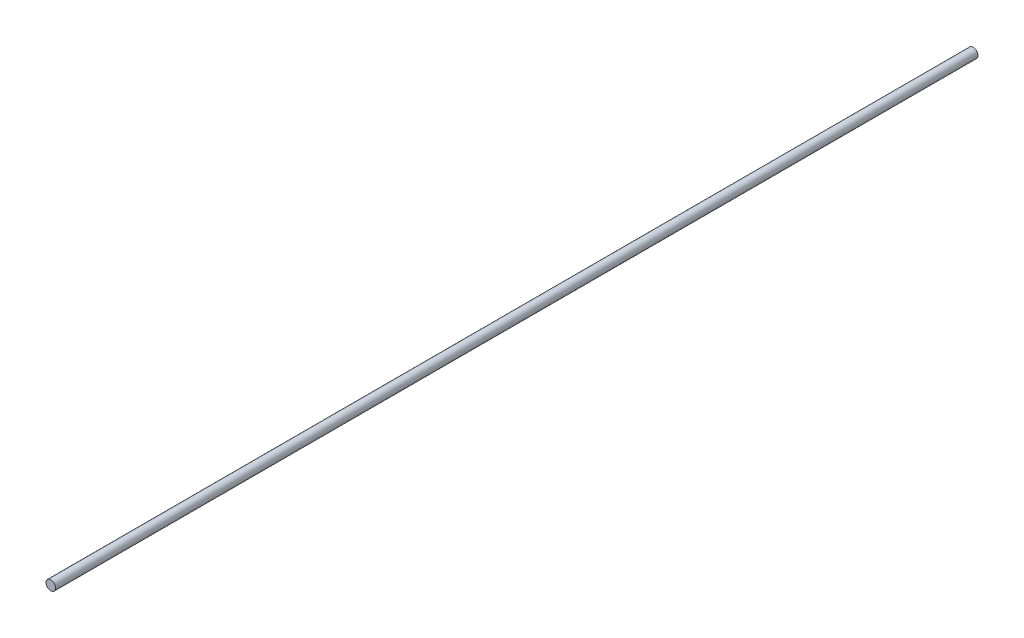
ISO-10303-21;
HEADER;
FILE_DESCRIPTION(('STEP AP214'),'2;1');
FILE_NAME('part.step','',(''),(''),'','','');
FILE_SCHEMA(('AUTOMOTIVE_DESIGN { 1 0 10303 214 1 1 1 1 }'));
ENDSEC;
DATA;
#1=APPLICATION_CONTEXT('core data for automotive mechanical design processes');
#2=APPLICATION_PROTOCOL_DEFINITION('international standard','automotive_design',2000,#1);
#3=PRODUCT_CONTEXT('',#1,'mechanical');
#4=PRODUCT('Part','Part','',(#3));
#5=PRODUCT_RELATED_PRODUCT_CATEGORY('part','',(#4));
#6=PRODUCT_DEFINITION_FORMATION('','',#4);
#7=PRODUCT_DEFINITION_CONTEXT('part definition',#1,'design');
#8=PRODUCT_DEFINITION('design','',#6,#7);
#9=PRODUCT_DEFINITION_SHAPE('','',#8);
#10=(LENGTH_UNIT() NAMED_UNIT(*) SI_UNIT(.MILLI.,.METRE.));
#11=(NAMED_UNIT(*) PLANE_ANGLE_UNIT() SI_UNIT($,.RADIAN.));
#12=(NAMED_UNIT(*) SI_UNIT($,.STERADIAN.) SOLID_ANGLE_UNIT());
#13=UNCERTAINTY_MEASURE_WITH_UNIT(LENGTH_MEASURE(1.E-05),#10,'distance_accuracy_value','');
#14=(GEOMETRIC_REPRESENTATION_CONTEXT(3) GLOBAL_UNCERTAINTY_ASSIGNED_CONTEXT((#13)) GLOBAL_UNIT_ASSIGNED_CONTEXT((#10,
#11,#12)) REPRESENTATION_CONTEXT('',''));
#15=CARTESIAN_POINT('',(0.,0.,0.));
#16=DIRECTION('',(0.,0.,1.));
#17=DIRECTION('',(1.,0.,0.));
#18=AXIS2_PLACEMENT_3D('',#15,#16,#17);
#19=CARTESIAN_POINT('',(0.,0.,-5800.));
#20=DIRECTION('',(0.,0.,1.));
#21=DIRECTION('',(1.,0.,0.));
#22=AXIS2_PLACEMENT_3D('',#19,#20,#21);
#23=CYLINDRICAL_SURFACE('',#22,30.);
#24=CARTESIAN_POINT('',(0.,0.,-5800.));
#25=DIRECTION('',(0.,0.,1.));
#26=DIRECTION('',(1.,0.,0.));
#27=AXIS2_PLACEMENT_3D('',#24,#25,#26);
#28=CIRCLE('',#27,30.);
#29=CARTESIAN_POINT('',(30.,0.,-5800.));
#30=VERTEX_POINT('',#29);
#31=EDGE_CURVE('E10',#30,#30,#28,.T.);
#32=ORIENTED_EDGE('',*,*,#31,.T.);
#33=EDGE_LOOP('',(#32));
#34=FACE_BOUND('',#33,.T.);
#35=CARTESIAN_POINT('',(0.,0.,0.));
#36=DIRECTION('',(0.,0.,1.));
#37=DIRECTION('',(1.,0.,0.));
#38=AXIS2_PLACEMENT_3D('',#35,#36,#37);
#39=CIRCLE('',#38,30.);
#40=CARTESIAN_POINT('',(30.,0.,0.));
#41=VERTEX_POINT('',#40);
#42=EDGE_CURVE('E40',#41,#41,#39,.T.);
#43=ORIENTED_EDGE('',*,*,#42,.F.);
#44=EDGE_LOOP('',(#43));
#45=FACE_BOUND('',#44,.T.);
#46=ADVANCED_FACE('F37',(#34,#45),#23,.T.);
#47=CARTESIAN_POINT('',(0.,0.,-5800.));
#48=DIRECTION('',(0.,0.,1.));
#49=DIRECTION('',(1.,0.,0.));
#50=AXIS2_PLACEMENT_3D('',#47,#48,#49);
#51=PLANE('',#50);
#52=ORIENTED_EDGE('',*,*,#31,.F.);
#53=EDGE_LOOP('',(#52));
#54=FACE_BOUND('',#53,.T.);
#55=ADVANCED_FACE('F54',(#54),#51,.F.);
#56=CARTESIAN_POINT('',(0.,0.,0.));
#57=DIRECTION('',(0.,0.,1.));
#58=DIRECTION('',(1.,0.,0.));
#59=AXIS2_PLACEMENT_3D('',#56,#57,#58);
#60=PLANE('',#59);
#61=ORIENTED_EDGE('',*,*,#42,.T.);
#62=EDGE_LOOP('',(#61));
#63=FACE_BOUND('',#62,.T.);
#64=ADVANCED_FACE('F51',(#63),#60,.T.);
#65=CLOSED_SHELL('',(#46,#55,#64));
#66=MANIFOLD_SOLID_BREP('B2',#65);
#67=ADVANCED_BREP_SHAPE_REPRESENTATION('',(#18,#66),#14);
#68=SHAPE_DEFINITION_REPRESENTATION(#9,#67);
ENDSEC;
END-ISO-10303-21;
